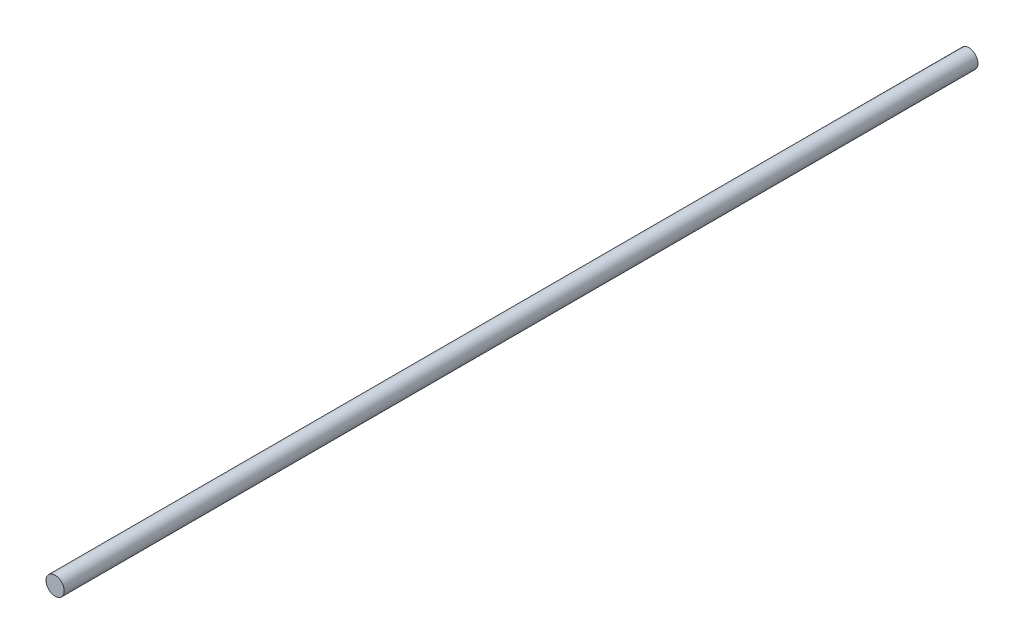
ISO-10303-21;
HEADER;
FILE_DESCRIPTION(('STEP AP214'),'2;1');
FILE_NAME('part.step','',(''),(''),'','','');
FILE_SCHEMA(('AUTOMOTIVE_DESIGN { 1 0 10303 214 1 1 1 1 }'));
ENDSEC;
DATA;
#1=APPLICATION_CONTEXT('core data for automotive mechanical design processes');
#2=APPLICATION_PROTOCOL_DEFINITION('international standard','automotive_design',2000,#1);
#3=PRODUCT_CONTEXT('',#1,'mechanical');
#4=PRODUCT('Part','Part','',(#3));
#5=PRODUCT_RELATED_PRODUCT_CATEGORY('part','',(#4));
#6=PRODUCT_DEFINITION_FORMATION('','',#4);
#7=PRODUCT_DEFINITION_CONTEXT('part definition',#1,'design');
#8=PRODUCT_DEFINITION('design','',#6,#7);
#9=PRODUCT_DEFINITION_SHAPE('','',#8);
#10=(LENGTH_UNIT() NAMED_UNIT(*) SI_UNIT(.MILLI.,.METRE.));
#11=(NAMED_UNIT(*) PLANE_ANGLE_UNIT() SI_UNIT($,.RADIAN.));
#12=(NAMED_UNIT(*) SI_UNIT($,.STERADIAN.) SOLID_ANGLE_UNIT());
#13=UNCERTAINTY_MEASURE_WITH_UNIT(LENGTH_MEASURE(1.E-05),#10,'distance_accuracy_value','');
#14=(GEOMETRIC_REPRESENTATION_CONTEXT(3) GLOBAL_UNCERTAINTY_ASSIGNED_CONTEXT((#13)) GLOBAL_UNIT_ASSIGNED_CONTEXT((#10,
#11,#12)) REPRESENTATION_CONTEXT('',''));
#15=CARTESIAN_POINT('',(0.,0.,0.));
#16=DIRECTION('',(0.,0.,1.));
#17=DIRECTION('',(1.,0.,0.));
#18=AXIS2_PLACEMENT_3D('',#15,#16,#17);
#19=CARTESIAN_POINT('',(0.,0.,1000.));
#20=DIRECTION('',(0.,0.,-1.));
#21=DIRECTION('',(-1.,0.,0.));
#22=AXIS2_PLACEMENT_3D('',#19,#20,#21);
#23=CYLINDRICAL_SURFACE('',#22,10.);
#24=CARTESIAN_POINT('',(0.,0.,1000.));
#25=DIRECTION('',(0.,0.,1.));
#26=DIRECTION('',(1.,0.,0.));
#27=AXIS2_PLACEMENT_3D('',#24,#25,#26);
#28=CIRCLE('',#27,10.);
#29=CARTESIAN_POINT('',(10.,0.,1000.));
#30=VERTEX_POINT('',#29);
#31=EDGE_CURVE('E10',#30,#30,#28,.T.);
#32=ORIENTED_EDGE('',*,*,#31,.F.);
#33=EDGE_LOOP('',(#32));
#34=FACE_BOUND('',#33,.T.);
#35=CARTESIAN_POINT('',(0.,0.,0.));
#36=DIRECTION('',(0.,0.,1.));
#37=DIRECTION('',(1.,0.,0.));
#38=AXIS2_PLACEMENT_3D('',#35,#36,#37);
#39=CIRCLE('',#38,10.);
#40=CARTESIAN_POINT('',(10.,0.,0.));
#41=VERTEX_POINT('',#40);
#42=EDGE_CURVE('E46',#41,#41,#39,.T.);
#43=ORIENTED_EDGE('',*,*,#42,.T.);
#44=EDGE_LOOP('',(#43));
#45=FACE_BOUND('',#44,.T.);
#46=ADVANCED_FACE('F43',(#34,#45),#23,.T.);
#47=CARTESIAN_POINT('',(0.,0.,1000.));
#48=DIRECTION('',(0.,0.,1.));
#49=DIRECTION('',(1.,0.,0.));
#50=AXIS2_PLACEMENT_3D('',#47,#48,#49);
#51=PLANE('',#50);
#52=ORIENTED_EDGE('',*,*,#31,.T.);
#53=EDGE_LOOP('',(#52));
#54=FACE_BOUND('',#53,.T.);
#55=ADVANCED_FACE('F60',(#54),#51,.T.);
#56=CARTESIAN_POINT('',(0.,0.,0.));
#57=DIRECTION('',(0.,0.,1.));
#58=DIRECTION('',(1.,0.,0.));
#59=AXIS2_PLACEMENT_3D('',#56,#57,#58);
#60=PLANE('',#59);
#61=ORIENTED_EDGE('',*,*,#42,.F.);
#62=EDGE_LOOP('',(#61));
#63=FACE_BOUND('',#62,.T.);
#64=ADVANCED_FACE('F58',(#63),#60,.F.);
#65=CLOSED_SHELL('',(#46,#55,#64));
#66=MANIFOLD_SOLID_BREP('B2',#65);
#67=ADVANCED_BREP_SHAPE_REPRESENTATION('',(#18,#66),#14);
#68=SHAPE_DEFINITION_REPRESENTATION(#9,#67);
ENDSEC;
END-ISO-10303-21;
